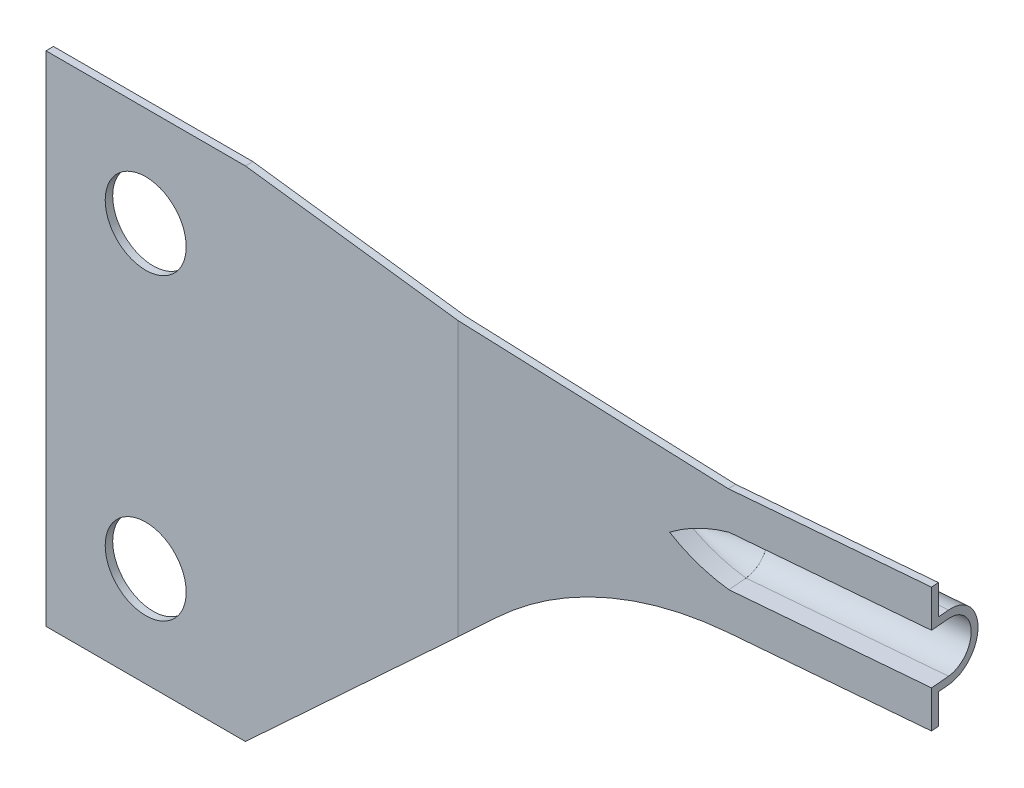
ISO-10303-21;
HEADER;
FILE_DESCRIPTION(('STEP AP214'),'2;1');
FILE_NAME('part.step','',(''),(''),'','','');
FILE_SCHEMA(('AUTOMOTIVE_DESIGN { 1 0 10303 214 1 1 1 1 }'));
ENDSEC;
DATA;
#1=APPLICATION_CONTEXT('core data for automotive mechanical design processes');
#2=APPLICATION_PROTOCOL_DEFINITION('international standard','automotive_design',2000,#1);
#3=PRODUCT_CONTEXT('',#1,'mechanical');
#4=PRODUCT('Part','Part','',(#3));
#5=PRODUCT_RELATED_PRODUCT_CATEGORY('part','',(#4));
#6=PRODUCT_DEFINITION_FORMATION('','',#4);
#7=PRODUCT_DEFINITION_CONTEXT('part definition',#1,'design');
#8=PRODUCT_DEFINITION('design','',#6,#7);
#9=PRODUCT_DEFINITION_SHAPE('','',#8);
#10=(LENGTH_UNIT() NAMED_UNIT(*) SI_UNIT(.MILLI.,.METRE.));
#11=(NAMED_UNIT(*) PLANE_ANGLE_UNIT() SI_UNIT($,.RADIAN.));
#12=(NAMED_UNIT(*) SI_UNIT($,.STERADIAN.) SOLID_ANGLE_UNIT());
#13=UNCERTAINTY_MEASURE_WITH_UNIT(LENGTH_MEASURE(1.E-05),#10,'distance_accuracy_value','');
#14=(GEOMETRIC_REPRESENTATION_CONTEXT(3) GLOBAL_UNCERTAINTY_ASSIGNED_CONTEXT((#13)) GLOBAL_UNIT_ASSIGNED_CONTEXT((#10,
#11,#12)) REPRESENTATION_CONTEXT('',''));
#15=CARTESIAN_POINT('',(0.,0.,0.));
#16=DIRECTION('',(0.,0.,1.));
#17=DIRECTION('',(1.,0.,0.));
#18=AXIS2_PLACEMENT_3D('',#15,#16,#17);
#19=CARTESIAN_POINT('',(33.0763632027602,40.,9.40000000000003));
#20=DIRECTION('',(-0.0871557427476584,0.,-0.996194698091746));
#21=DIRECTION('',(-0.996194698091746,0.,0.0871557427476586));
#22=AXIS2_PLACEMENT_3D('',#19,#20,#21);
#23=PLANE('',#22);
#24=DIRECTION('',(0.,-1.,0.));
#25=VECTOR('',#24,1.);
#26=CARTESIAN_POINT('',(53.004985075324,32.8000000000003,7.65647150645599));
#27=LINE('',#26,#25);
#28=CARTESIAN_POINT('',(53.004985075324,32.8000000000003,7.65647150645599));
#29=VERTEX_POINT('',#28);
#30=CARTESIAN_POINT('',(53.004985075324,32.7982298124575,7.6564715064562));
#31=VERTEX_POINT('',#30);
#32=EDGE_CURVE('E223',#29,#31,#27,.T.);
#33=ORIENTED_EDGE('',*,*,#32,.T.);
#34=CARTESIAN_POINT('',(56.2252552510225,20.467428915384,7.37473437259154));
#35=DIRECTION('',(-0.0871557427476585,0.,-0.996194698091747));
#36=DIRECTION('',(-0.996194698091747,0.,0.0871557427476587));
#37=AXIS2_PLACEMENT_3D('',#34,#35,#36);
#38=CIRCLE('',#37,12.7474768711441);
#39=CARTESIAN_POINT('',(48.0240115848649,30.2000000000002,8.09225022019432));
#40=VERTEX_POINT('',#39);
#41=EDGE_CURVE('E205',#40,#31,#38,.T.);
#42=ORIENTED_EDGE('',*,*,#41,.F.);
#43=CARTESIAN_POINT('',(56.2252552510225,39.932571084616,7.37473437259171));
#44=DIRECTION('',(-0.0871557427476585,0.,-0.996194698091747));
#45=DIRECTION('',(-0.996194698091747,0.,0.0871557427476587));
#46=AXIS2_PLACEMENT_3D('',#43,#44,#45);
#47=CIRCLE('',#46,12.7474768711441);
#48=CARTESIAN_POINT('',(53.004985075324,27.6017701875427,7.65647150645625));
#49=VERTEX_POINT('',#48);
#50=EDGE_CURVE('E214',#49,#40,#47,.T.);
#51=ORIENTED_EDGE('',*,*,#50,.F.);
#52=DIRECTION('',(0.,-1.,0.));
#53=VECTOR('',#52,1.);
#54=CARTESIAN_POINT('',(53.0049850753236,28.1999999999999,7.65647150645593));
#55=LINE('',#54,#53);
#56=CARTESIAN_POINT('',(53.0049850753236,27.6000000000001,7.65647150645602));
#57=VERTEX_POINT('',#56);
#58=EDGE_CURVE('E292',#49,#57,#55,.T.);
#59=ORIENTED_EDGE('',*,*,#58,.T.);
#60=DIRECTION('',(0.996194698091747,0.,-0.0871557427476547));
#61=VECTOR('',#60,1.);
#62=CARTESIAN_POINT('',(53.0049850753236,27.6000000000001,7.65647150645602));
#63=LINE('',#62,#61);
#64=CARTESIAN_POINT('',(67.9479055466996,27.6,6.34913536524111));
#65=VERTEX_POINT('',#64);
#66=EDGE_CURVE('E301',#57,#65,#63,.T.);
#67=ORIENTED_EDGE('',*,*,#66,.T.);
#68=DIRECTION('',(0.,1.,0.));
#69=VECTOR('',#68,1.);
#70=CARTESIAN_POINT('',(67.9479055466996,40.0000000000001,6.34913536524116));
#71=LINE('',#70,#69);
#72=CARTESIAN_POINT('',(67.9479055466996,25.2000000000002,6.34913536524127));
#73=VERTEX_POINT('',#72);
#74=EDGE_CURVE('E11',#73,#65,#71,.T.);
#75=ORIENTED_EDGE('',*,*,#74,.F.);
#76=DIRECTION('',(-0.996194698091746,0.,0.0871557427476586));
#77=VECTOR('',#76,1.);
#78=CARTESIAN_POINT('',(67.6826212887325,25.1999999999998,6.37234473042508));
#79=LINE('',#78,#77);
#80=CARTESIAN_POINT('',(52.9999999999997,25.2000000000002,7.65690764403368));
#81=VERTEX_POINT('',#80);
#82=EDGE_CURVE('E336',#73,#81,#79,.T.);
#83=ORIENTED_EDGE('',*,*,#82,.T.);
#84=CARTESIAN_POINT('',(53.0000000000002,0.199999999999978,7.6569076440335));
#85=DIRECTION('',(-0.0871557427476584,0.,-0.996194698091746));
#86=DIRECTION('',(0.996194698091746,0.,-0.0871557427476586));
#87=AXIS2_PLACEMENT_3D('',#84,#85,#86);
#88=ELLIPSE('',#87,25.0954959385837,25.);
#89=CARTESIAN_POINT('',(36.0089803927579,18.5386273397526,9.14342924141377));
#90=VERTEX_POINT('',#89);
#91=EDGE_CURVE('E338',#81,#90,#88,.F.);
#92=ORIENTED_EDGE('',*,*,#91,.T.);
#93=DIRECTION('',(-0.732039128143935,-0.678245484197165,0.0640451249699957));
#94=VECTOR('',#93,1.);
#95=CARTESIAN_POINT('',(16.041913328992,0.0388333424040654,10.8903212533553));
#96=LINE('',#95,#94);
#97=CARTESIAN_POINT('',(33.07636320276,15.8215125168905,9.40000000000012));
#98=VERTEX_POINT('',#97);
#99=EDGE_CURVE('E340',#90,#98,#96,.T.);
#100=ORIENTED_EDGE('',*,*,#99,.T.);
#101=DIRECTION('',(0.,-1.,0.));
#102=VECTOR('',#101,1.);
#103=CARTESIAN_POINT('',(33.0763632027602,40.,9.40000000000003));
#104=LINE('',#103,#102);
#105=CARTESIAN_POINT('',(33.0763632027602,37.7846880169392,9.40000000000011));
#106=VERTEX_POINT('',#105);
#107=EDGE_CURVE('E315',#106,#98,#104,.T.);
#108=ORIENTED_EDGE('',*,*,#107,.F.);
#109=DIRECTION('',(0.987978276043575,-0.128170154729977,-0.0864368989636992));
#110=VECTOR('',#109,1.);
#111=CARTESIAN_POINT('',(16.0763446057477,39.9900958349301,10.8873089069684));
#112=LINE('',#111,#110);
#113=CARTESIAN_POINT('',(53.0000000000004,35.2,7.65690764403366));
#114=VERTEX_POINT('',#113);
#115=EDGE_CURVE('E398',#106,#114,#112,.T.);
#116=ORIENTED_EDGE('',*,*,#115,.T.);
#117=DIRECTION('',(0.996194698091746,0.,-0.0871557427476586));
#118=VECTOR('',#117,1.);
#119=CARTESIAN_POINT('',(67.682621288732,35.1999999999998,6.37234473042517));
#120=LINE('',#119,#118);
#121=CARTESIAN_POINT('',(67.9479055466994,35.2,6.34913536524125));
#122=VERTEX_POINT('',#121);
#123=EDGE_CURVE('E333',#114,#122,#120,.T.);
#124=ORIENTED_EDGE('',*,*,#123,.T.);
#125=CARTESIAN_POINT('',(67.9479055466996,32.8000000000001,6.34913536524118));
#126=VERTEX_POINT('',#125);
#127=EDGE_CURVE('E42',#126,#122,#71,.T.);
#128=ORIENTED_EDGE('',*,*,#127,.F.);
#129=DIRECTION('',(0.996194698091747,0.,-0.0871557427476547));
#130=VECTOR('',#129,1.);
#131=CARTESIAN_POINT('',(53.004985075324,32.8000000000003,7.65647150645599));
#132=LINE('',#131,#130);
#133=EDGE_CURVE('E308',#29,#126,#132,.T.);
#134=ORIENTED_EDGE('',*,*,#133,.F.);
#135=EDGE_LOOP('',(#33,#42,#51,#59,#67,#75,#83,#92,#100,#108,#116,#124,#128,#134));
#136=FACE_BOUND('',#135,.T.);
#137=ADVANCED_FACE('F34',(#136),#23,.T.);
#138=CARTESIAN_POINT('',(52.926345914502,30.2000000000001,6.75762178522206));
#139=DIRECTION('',(-0.996194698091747,0.,0.0871557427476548));
#140=DIRECTION('',(0.0871557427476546,0.,0.996194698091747));
#141=AXIS2_PLACEMENT_3D('',#138,#139,#140);
#142=PLANE('',#141);
#143=CARTESIAN_POINT('',(52.926345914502,30.2000000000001,6.75762178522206));
#144=DIRECTION('',(0.996194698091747,0.,-0.0871557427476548));
#145=DIRECTION('',(-0.0871557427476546,0.,-0.996194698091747));
#146=AXIS2_PLACEMENT_3D('',#143,#144,#145);
#147=CIRCLE('',#146,2.59822981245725);
#148=CARTESIAN_POINT('',(52.9263459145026,27.601770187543,6.75762178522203));
#149=VERTEX_POINT('',#148);
#150=CARTESIAN_POINT('',(52.9263459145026,32.7982298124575,6.75762178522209));
#151=VERTEX_POINT('',#150);
#152=EDGE_CURVE('E250',#149,#151,#147,.T.);
#153=ORIENTED_EDGE('',*,*,#152,.T.);
#154=DIRECTION('',(0.0871557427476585,0.,0.996194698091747));
#155=VECTOR('',#154,1.);
#156=CARTESIAN_POINT('',(52.2978376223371,32.7982298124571,-0.426260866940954));
#157=LINE('',#156,#155);
#158=EDGE_CURVE('E211',#151,#31,#157,.T.);
#159=ORIENTED_EDGE('',*,*,#158,.T.);
#160=ORIENTED_EDGE('',*,*,#32,.F.);
#161=DIRECTION('',(0.0871557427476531,0.,0.996194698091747));
#162=VECTOR('',#161,1.);
#163=CARTESIAN_POINT('',(52.9263459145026,32.8000000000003,6.7576217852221));
#164=LINE('',#163,#162);
#165=CARTESIAN_POINT('',(52.9263459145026,32.8000000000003,6.7576217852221));
#166=VERTEX_POINT('',#165);
#167=EDGE_CURVE('E281',#166,#29,#164,.T.);
#168=ORIENTED_EDGE('',*,*,#167,.F.);
#169=CARTESIAN_POINT('',(52.926345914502,30.2000000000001,6.75762178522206));
#170=DIRECTION('',(0.996194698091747,0.,-0.0871557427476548));
#171=DIRECTION('',(0.0871557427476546,0.,0.996194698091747));
#172=AXIS2_PLACEMENT_3D('',#169,#170,#171);
#173=CIRCLE('',#172,2.60000000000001);
#174=CARTESIAN_POINT('',(52.9263459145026,27.6000000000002,6.75762178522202));
#175=VERTEX_POINT('',#174);
#176=EDGE_CURVE('E278',#175,#166,#173,.T.);
#177=ORIENTED_EDGE('',*,*,#176,.F.);
#178=DIRECTION('',(-0.0871557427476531,0.,-0.996194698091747));
#179=VECTOR('',#178,1.);
#180=CARTESIAN_POINT('',(52.9263459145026,27.6000000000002,6.75762178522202));
#181=LINE('',#180,#179);
#182=EDGE_CURVE('E294',#57,#175,#181,.T.);
#183=ORIENTED_EDGE('',*,*,#182,.F.);
#184=ORIENTED_EDGE('',*,*,#58,.F.);
#185=DIRECTION('',(0.0871557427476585,0.,0.996194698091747));
#186=VECTOR('',#185,1.);
#187=CARTESIAN_POINT('',(52.2978376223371,27.6017701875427,-0.426260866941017));
#188=LINE('',#187,#186);
#189=EDGE_CURVE('E217',#149,#49,#188,.T.);
#190=ORIENTED_EDGE('',*,*,#189,.F.);
#191=EDGE_LOOP('',(#153,#159,#160,#168,#177,#183,#184,#190));
#192=FACE_BOUND('',#191,.T.);
#193=ADVANCED_FACE('F449',(#192),#142,.T.);
#194=CARTESIAN_POINT('',(16.0000000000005,0.,10.0000000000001));
#195=DIRECTION('',(-0.679640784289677,0.733545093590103,0.));
#196=DIRECTION('',(-0.733545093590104,-0.679640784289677,0.));
#197=AXIS2_PLACEMENT_3D('',#194,#195,#196);
#198=PLANE('',#197);
#199=ORIENTED_EDGE('',*,*,#99,.F.);
#200=DIRECTION('',(0.,0.,-1.));
#201=VECTOR('',#200,1.);
#202=CARTESIAN_POINT('',(36.0089803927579,18.5386273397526,10.0000000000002));
#203=LINE('',#202,#201);
#204=CARTESIAN_POINT('',(36.0089803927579,18.5386273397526,9.7434292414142));
#205=VERTEX_POINT('',#204);
#206=EDGE_CURVE('E387',#205,#90,#203,.T.);
#207=ORIENTED_EDGE('',*,*,#206,.F.);
#208=DIRECTION('',(0.732039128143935,0.678245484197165,-0.0640451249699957));
#209=VECTOR('',#208,1.);
#210=CARTESIAN_POINT('',(16.0700434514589,0.0648963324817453,11.4878601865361));
#211=LINE('',#210,#209);
#212=CARTESIAN_POINT('',(33.0763632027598,15.8215125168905,9.99999999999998));
#213=VERTEX_POINT('',#212);
#214=EDGE_CURVE('E355',#213,#205,#211,.T.);
#215=ORIENTED_EDGE('',*,*,#214,.F.);
#216=DIRECTION('',(0.733545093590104,0.679640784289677,0.));
#217=VECTOR('',#216,1.);
#218=CARTESIAN_POINT('',(16.0000000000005,0.,10.0000000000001));
#219=LINE('',#218,#217);
#220=CARTESIAN_POINT('',(16.0000000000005,0.,10.0000000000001));
#221=VERTEX_POINT('',#220);
#222=EDGE_CURVE('E368',#221,#213,#219,.T.);
#223=ORIENTED_EDGE('',*,*,#222,.F.);
#224=DIRECTION('',(0.,0.,-1.));
#225=VECTOR('',#224,1.);
#226=CARTESIAN_POINT('',(16.0000000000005,0.,10.0000000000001));
#227=LINE('',#226,#225);
#228=CARTESIAN_POINT('',(15.9999999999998,-1.11022302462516E-13,9.40000000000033));
#229=VERTEX_POINT('',#228);
#230=EDGE_CURVE('E390',#221,#229,#227,.T.);
#231=ORIENTED_EDGE('',*,*,#230,.T.);
#232=DIRECTION('',(-0.733545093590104,-0.679640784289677,0.));
#233=VECTOR('',#232,1.);
#234=CARTESIAN_POINT('',(15.9999999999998,-1.11022302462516E-13,9.40000000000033));
#235=LINE('',#234,#233);
#236=EDGE_CURVE('E331',#98,#229,#235,.T.);
#237=ORIENTED_EDGE('',*,*,#236,.F.);
#238=EDGE_LOOP('',(#199,#207,#215,#223,#231,#237));
#239=FACE_BOUND('',#238,.T.);
#240=ADVANCED_FACE('F431',(#239),#198,.F.);
#241=CARTESIAN_POINT('',(53.0000000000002,0.200000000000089,10.0000000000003));
#242=DIRECTION('',(0.,0.,-1.));
#243=DIRECTION('',(-1.,0.,0.));
#244=AXIS2_PLACEMENT_3D('',#241,#242,#243);
#245=CYLINDRICAL_SURFACE('',#244,25.);
#246=ORIENTED_EDGE('',*,*,#91,.F.);
#247=DIRECTION('',(0.,0.,-1.));
#248=VECTOR('',#247,1.);
#249=CARTESIAN_POINT('',(52.9999999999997,25.2000000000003,10.0000000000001));
#250=LINE('',#249,#248);
#251=CARTESIAN_POINT('',(52.9999999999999,25.2000000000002,8.25690764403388));
#252=VERTEX_POINT('',#251);
#253=EDGE_CURVE('E384',#252,#81,#250,.T.);
#254=ORIENTED_EDGE('',*,*,#253,.F.);
#255=CARTESIAN_POINT('',(52.9999999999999,0.199999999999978,8.25690764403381));
#256=DIRECTION('',(0.0871557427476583,0.,0.996194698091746));
#257=DIRECTION('',(0.996194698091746,0.,-0.0871557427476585));
#258=AXIS2_PLACEMENT_3D('',#255,#256,#257);
#259=ELLIPSE('',#258,25.0954959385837,25.);
#260=EDGE_CURVE('E353',#205,#252,#259,.F.);
#261=ORIENTED_EDGE('',*,*,#260,.F.);
#262=ORIENTED_EDGE('',*,*,#206,.T.);
#263=EDGE_LOOP('',(#246,#254,#261,#262));
#264=FACE_BOUND('',#263,.T.);
#265=ADVANCED_FACE('F435',(#264),#245,.F.);
#266=CARTESIAN_POINT('',(67.9999999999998,25.1999999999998,9.99999999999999));
#267=DIRECTION('',(0.,1.,0.));
#268=DIRECTION('',(0.,0.,1.));
#269=AXIS2_PLACEMENT_3D('',#266,#267,#268);
#270=PLANE('',#269);
#271=ORIENTED_EDGE('',*,*,#82,.F.);
#272=DIRECTION('',(-0.0871557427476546,0.,-0.996194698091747));
#273=VECTOR('',#272,1.);
#274=CARTESIAN_POINT('',(68.0000000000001,25.1999999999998,6.94457769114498));
#275=LINE('',#274,#273);
#276=CARTESIAN_POINT('',(68.0000000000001,25.1999999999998,6.94457769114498));
#277=VERTEX_POINT('',#276);
#278=EDGE_CURVE('E300',#277,#73,#275,.T.);
#279=ORIENTED_EDGE('',*,*,#278,.F.);
#280=DIRECTION('',(0.996194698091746,0.,-0.0871557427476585));
#281=VECTOR('',#280,1.);
#282=CARTESIAN_POINT('',(67.7347157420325,25.2,6.9677870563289));
#283=LINE('',#282,#281);
#284=EDGE_CURVE('E350',#252,#277,#283,.T.);
#285=ORIENTED_EDGE('',*,*,#284,.F.);
#286=ORIENTED_EDGE('',*,*,#253,.T.);
#287=EDGE_LOOP('',(#271,#279,#285,#286));
#288=FACE_BOUND('',#287,.T.);
#289=ADVANCED_FACE('F441',(#288),#270,.F.);
#290=CARTESIAN_POINT('',(67.9999999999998,35.1999999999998,10.0000000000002));
#291=DIRECTION('',(0.,-1.,0.));
#292=DIRECTION('',(1.,0.,0.));
#293=AXIS2_PLACEMENT_3D('',#290,#291,#292);
#294=PLANE('',#293);
#295=DIRECTION('',(-0.996194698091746,0.,0.0871557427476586));
#296=VECTOR('',#295,1.);
#297=CARTESIAN_POINT('',(67.7347157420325,35.2,6.967787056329));
#298=LINE('',#297,#296);
#299=CARTESIAN_POINT('',(68.0000000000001,35.2,6.94457769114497));
#300=VERTEX_POINT('',#299);
#301=CARTESIAN_POINT('',(53.0000000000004,35.2000000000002,8.25690764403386));
#302=VERTEX_POINT('',#301);
#303=EDGE_CURVE('E344',#300,#302,#298,.T.);
#304=ORIENTED_EDGE('',*,*,#303,.F.);
#305=DIRECTION('',(-0.0871557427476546,0.,-0.996194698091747));
#306=VECTOR('',#305,1.);
#307=CARTESIAN_POINT('',(68.2652842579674,35.2,9.97679063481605));
#308=LINE('',#307,#306);
#309=EDGE_CURVE('E312',#300,#122,#308,.T.);
#310=ORIENTED_EDGE('',*,*,#309,.T.);
#311=ORIENTED_EDGE('',*,*,#123,.F.);
#312=DIRECTION('',(0.,0.,-1.));
#313=VECTOR('',#312,1.);
#314=CARTESIAN_POINT('',(53.0000000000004,35.2000000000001,10.0000000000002));
#315=LINE('',#314,#313);
#316=EDGE_CURVE('E381',#302,#114,#315,.T.);
#317=ORIENTED_EDGE('',*,*,#316,.F.);
#318=EDGE_LOOP('',(#304,#310,#311,#317));
#319=FACE_BOUND('',#318,.T.);
#320=ADVANCED_FACE('F409',(#319),#294,.F.);
#321=CARTESIAN_POINT('',(16.0000000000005,40.0000000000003,10.));
#322=DIRECTION('',(-0.128651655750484,-0.991689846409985,0.));
#323=DIRECTION('',(0.991689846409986,-0.128651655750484,0.));
#324=AXIS2_PLACEMENT_3D('',#321,#322,#323);
#325=PLANE('',#324);
#326=ORIENTED_EDGE('',*,*,#115,.F.);
#327=DIRECTION('',(0.991689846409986,-0.128651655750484,0.));
#328=VECTOR('',#327,1.);
#329=CARTESIAN_POINT('',(15.9999999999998,40.0000000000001,9.40000000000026));
#330=LINE('',#329,#328);
#331=CARTESIAN_POINT('',(15.9999999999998,40.0000000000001,9.40000000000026));
#332=VERTEX_POINT('',#331);
#333=EDGE_CURVE('E329',#332,#106,#330,.T.);
#334=ORIENTED_EDGE('',*,*,#333,.F.);
#335=DIRECTION('',(0.,0.,-1.));
#336=VECTOR('',#335,1.);
#337=CARTESIAN_POINT('',(16.0000000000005,40.0000000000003,10.));
#338=LINE('',#337,#336);
#339=CARTESIAN_POINT('',(16.0000000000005,40.0000000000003,10.));
#340=VERTEX_POINT('',#339);
#341=EDGE_CURVE('E378',#340,#332,#338,.T.);
#342=ORIENTED_EDGE('',*,*,#341,.F.);
#343=DIRECTION('',(-0.991689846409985,0.128651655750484,0.));
#344=VECTOR('',#343,1.);
#345=CARTESIAN_POINT('',(16.0000000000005,40.0000000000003,10.));
#346=LINE('',#345,#344);
#347=CARTESIAN_POINT('',(33.0763632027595,37.7846880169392,10.0000000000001));
#348=VERTEX_POINT('',#347);
#349=EDGE_CURVE('E371',#348,#340,#346,.T.);
#350=ORIENTED_EDGE('',*,*,#349,.F.);
#351=DIRECTION('',(-0.987978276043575,0.128170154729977,0.0864368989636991));
#352=VECTOR('',#351,1.);
#353=CARTESIAN_POINT('',(16.1275832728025,39.9834486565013,11.482826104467));
#354=LINE('',#353,#352);
#355=EDGE_CURVE('E396',#302,#348,#354,.T.);
#356=ORIENTED_EDGE('',*,*,#355,.F.);
#357=ORIENTED_EDGE('',*,*,#316,.T.);
#358=EDGE_LOOP('',(#326,#334,#342,#350,#356,#357));
#359=FACE_BOUND('',#358,.T.);
#360=ADVANCED_FACE('F418',(#359),#325,.F.);
#361=CARTESIAN_POINT('',(0.,1.11022302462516E-13,9.9999999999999));
#362=DIRECTION('',(1.,0.,0.));
#363=DIRECTION('',(0.,0.,-1.));
#364=AXIS2_PLACEMENT_3D('',#361,#362,#363);
#365=PLANE('',#364);
#366=DIRECTION('',(0.,1.,0.));
#367=VECTOR('',#366,1.);
#368=CARTESIAN_POINT('',(0.,1.11022302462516E-13,9.40000000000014));
#369=LINE('',#368,#367);
#370=CARTESIAN_POINT('',(0.,1.11022302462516E-13,9.40000000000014));
#371=VERTEX_POINT('',#370);
#372=CARTESIAN_POINT('',(0.,39.9999999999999,9.40000000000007));
#373=VERTEX_POINT('',#372);
#374=EDGE_CURVE('E327',#371,#373,#369,.T.);
#375=ORIENTED_EDGE('',*,*,#374,.F.);
#376=DIRECTION('',(0.,0.,-1.));
#377=VECTOR('',#376,1.);
#378=CARTESIAN_POINT('',(0.,1.11022302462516E-13,9.9999999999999));
#379=LINE('',#378,#377);
#380=CARTESIAN_POINT('',(0.,1.11022302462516E-13,9.9999999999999));
#381=VERTEX_POINT('',#380);
#382=EDGE_CURVE('E393',#381,#371,#379,.T.);
#383=ORIENTED_EDGE('',*,*,#382,.F.);
#384=DIRECTION('',(0.,-1.,0.));
#385=VECTOR('',#384,1.);
#386=CARTESIAN_POINT('',(0.,1.11022302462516E-13,9.9999999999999));
#387=LINE('',#386,#385);
#388=CARTESIAN_POINT('',(-2.22044604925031E-13,39.9999999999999,10.0000000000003));
#389=VERTEX_POINT('',#388);
#390=EDGE_CURVE('E363',#389,#381,#387,.T.);
#391=ORIENTED_EDGE('',*,*,#390,.F.);
#392=DIRECTION('',(0.,0.,-1.));
#393=VECTOR('',#392,1.);
#394=CARTESIAN_POINT('',(-2.22044604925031E-13,39.9999999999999,10.0000000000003));
#395=LINE('',#394,#393);
#396=EDGE_CURVE('E375',#389,#373,#395,.T.);
#397=ORIENTED_EDGE('',*,*,#396,.T.);
#398=EDGE_LOOP('',(#375,#383,#391,#397));
#399=FACE_BOUND('',#398,.T.);
#400=ADVANCED_FACE('F36',(#399),#365,.F.);
#401=CARTESIAN_POINT('',(0.,1.11022302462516E-13,9.9999999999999));
#402=DIRECTION('',(0.,1.,0.));
#403=DIRECTION('',(0.,0.,1.));
#404=AXIS2_PLACEMENT_3D('',#401,#402,#403);
#405=PLANE('',#404);
#406=DIRECTION('',(1.,0.,0.));
#407=VECTOR('',#406,1.);
#408=CARTESIAN_POINT('',(-11.0611395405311,3.33066907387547E-13,9.40000000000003));
#409=LINE('',#408,#407);
#410=EDGE_CURVE('E318',#371,#229,#409,.T.);
#411=ORIENTED_EDGE('',*,*,#410,.T.);
#412=ORIENTED_EDGE('',*,*,#230,.F.);
#413=DIRECTION('',(1.,0.,0.));
#414=VECTOR('',#413,1.);
#415=CARTESIAN_POINT('',(0.,1.11022302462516E-13,9.9999999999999));
#416=LINE('',#415,#414);
#417=EDGE_CURVE('E366',#381,#221,#416,.T.);
#418=ORIENTED_EDGE('',*,*,#417,.F.);
#419=ORIENTED_EDGE('',*,*,#382,.T.);
#420=EDGE_LOOP('',(#411,#412,#418,#419));
#421=FACE_BOUND('',#420,.T.);
#422=ADVANCED_FACE('F499',(#421),#405,.F.);
#423=CARTESIAN_POINT('',(-2.22044604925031E-13,39.9999999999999,10.0000000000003));
#424=DIRECTION('',(0.,-1.,0.));
#425=DIRECTION('',(0.,0.,-1.));
#426=AXIS2_PLACEMENT_3D('',#423,#424,#425);
#427=PLANE('',#426);
#428=DIRECTION('',(1.,0.,0.));
#429=VECTOR('',#428,1.);
#430=CARTESIAN_POINT('',(-11.0611395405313,40.,9.40000000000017));
#431=LINE('',#430,#429);
#432=EDGE_CURVE('E319',#373,#332,#431,.T.);
#433=ORIENTED_EDGE('',*,*,#432,.F.);
#434=ORIENTED_EDGE('',*,*,#396,.F.);
#435=DIRECTION('',(-1.,0.,0.));
#436=VECTOR('',#435,1.);
#437=CARTESIAN_POINT('',(-2.22044604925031E-13,39.9999999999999,10.0000000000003));
#438=LINE('',#437,#436);
#439=EDGE_CURVE('E373',#340,#389,#438,.T.);
#440=ORIENTED_EDGE('',*,*,#439,.F.);
#441=ORIENTED_EDGE('',*,*,#341,.T.);
#442=EDGE_LOOP('',(#433,#434,#440,#441));
#443=FACE_BOUND('',#442,.T.);
#444=ADVANCED_FACE('F492',(#443),#427,.F.);
#445=CARTESIAN_POINT('',(8.00000000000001,31.9999999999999,9.99999999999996));
#446=DIRECTION('',(0.,0.,-1.));
#447=DIRECTION('',(-1.,0.,0.));
#448=AXIS2_PLACEMENT_3D('',#445,#446,#447);
#449=CYLINDRICAL_SURFACE('',#448,3.25);
#450=CARTESIAN_POINT('',(8.00000000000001,31.9999999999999,9.99999999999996));
#451=DIRECTION('',(0.,0.,1.));
#452=DIRECTION('',(1.,0.,0.));
#453=AXIS2_PLACEMENT_3D('',#450,#451,#452);
#454=CIRCLE('',#453,3.25);
#455=CARTESIAN_POINT('',(11.25,31.9999999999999,9.99999999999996));
#456=VERTEX_POINT('',#455);
#457=EDGE_CURVE('E360',#456,#456,#454,.T.);
#458=ORIENTED_EDGE('',*,*,#457,.T.);
#459=EDGE_LOOP('',(#458));
#460=FACE_BOUND('',#459,.T.);
#461=CARTESIAN_POINT('',(7.99999999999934,31.9999999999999,9.40000000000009));
#462=DIRECTION('',(0.,0.,-1.));
#463=DIRECTION('',(-1.,0.,0.));
#464=AXIS2_PLACEMENT_3D('',#461,#462,#463);
#465=CIRCLE('',#464,3.25);
#466=CARTESIAN_POINT('',(4.74999999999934,31.9999999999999,9.40000000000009));
#467=VERTEX_POINT('',#466);
#468=EDGE_CURVE('E324',#467,#467,#465,.T.);
#469=ORIENTED_EDGE('',*,*,#468,.T.);
#470=EDGE_LOOP('',(#469));
#471=FACE_BOUND('',#470,.T.);
#472=ADVANCED_FACE('F488',(#460,#471),#449,.F.);
#473=CARTESIAN_POINT('',(8.00000000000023,7.9999999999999,10.0000000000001));
#474=DIRECTION('',(0.,0.,-1.));
#475=DIRECTION('',(-1.,0.,0.));
#476=AXIS2_PLACEMENT_3D('',#473,#474,#475);
#477=CYLINDRICAL_SURFACE('',#476,3.25);
#478=CARTESIAN_POINT('',(8.00000000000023,7.9999999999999,10.0000000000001));
#479=DIRECTION('',(0.,0.,1.));
#480=DIRECTION('',(1.,0.,0.));
#481=AXIS2_PLACEMENT_3D('',#478,#479,#480);
#482=CIRCLE('',#481,3.25);
#483=CARTESIAN_POINT('',(11.2500000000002,7.9999999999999,10.0000000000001));
#484=VERTEX_POINT('',#483);
#485=EDGE_CURVE('E357',#484,#484,#482,.T.);
#486=ORIENTED_EDGE('',*,*,#485,.T.);
#487=EDGE_LOOP('',(#486));
#488=FACE_BOUND('',#487,.T.);
#489=CARTESIAN_POINT('',(8.00000000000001,7.99999999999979,9.40000000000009));
#490=DIRECTION('',(0.,0.,-1.));
#491=DIRECTION('',(-1.,0.,0.));
#492=AXIS2_PLACEMENT_3D('',#489,#490,#491);
#493=CIRCLE('',#492,3.25);
#494=CARTESIAN_POINT('',(4.75,7.99999999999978,9.40000000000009));
#495=VERTEX_POINT('',#494);
#496=EDGE_CURVE('E321',#495,#495,#493,.T.);
#497=ORIENTED_EDGE('',*,*,#496,.T.);
#498=EDGE_LOOP('',(#497));
#499=FACE_BOUND('',#498,.T.);
#500=ADVANCED_FACE('F485',(#488,#499),#477,.F.);
#501=CARTESIAN_POINT('',(53.0000000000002,0.200000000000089,10.0000000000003));
#502=DIRECTION('',(0.,0.,1.));
#503=DIRECTION('',(1.,0.,0.));
#504=AXIS2_PLACEMENT_3D('',#501,#502,#503);
#505=PLANE('',#504);
#506=ORIENTED_EDGE('',*,*,#485,.F.);
#507=EDGE_LOOP('',(#506));
#508=FACE_BOUND('',#507,.T.);
#509=ORIENTED_EDGE('',*,*,#457,.F.);
#510=EDGE_LOOP('',(#509));
#511=FACE_BOUND('',#510,.T.);
#512=ORIENTED_EDGE('',*,*,#222,.T.);
#513=DIRECTION('',(0.,-1.,0.));
#514=VECTOR('',#513,1.);
#515=CARTESIAN_POINT('',(33.0763632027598,40.,10.));
#516=LINE('',#515,#514);
#517=EDGE_CURVE('E342',#348,#213,#516,.T.);
#518=ORIENTED_EDGE('',*,*,#517,.F.);
#519=ORIENTED_EDGE('',*,*,#349,.T.);
#520=ORIENTED_EDGE('',*,*,#439,.T.);
#521=ORIENTED_EDGE('',*,*,#390,.T.);
#522=ORIENTED_EDGE('',*,*,#417,.T.);
#523=EDGE_LOOP('',(#512,#518,#519,#520,#521,#522));
#524=FACE_BOUND('',#523,.T.);
#525=ADVANCED_FACE('F423',(#508,#511,#524),#505,.T.);
#526=CARTESIAN_POINT('',(33.0763632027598,40.,10.));
#527=DIRECTION('',(0.0871557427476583,0.,0.996194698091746));
#528=DIRECTION('',(0.996194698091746,0.,-0.0871557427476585));
#529=AXIS2_PLACEMENT_3D('',#526,#527,#528);
#530=PLANE('',#529);
#531=CARTESIAN_POINT('',(55.4678860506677,21.0260769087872,8.0409955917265));
#532=DIRECTION('',(0.0871557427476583,0.,0.996194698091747));
#533=DIRECTION('',(0.996194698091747,0.,-0.0871557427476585));
#534=AXIS2_PLACEMENT_3D('',#531,#532,#533);
#535=CIRCLE('',#534,11.4312499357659);
#536=CARTESIAN_POINT('',(53.057079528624,32.1982298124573,8.25191383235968));
#537=VERTEX_POINT('',#536);
#538=CARTESIAN_POINT('',(48.6738228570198,30.2000000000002,8.63539910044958));
#539=VERTEX_POINT('',#538);
#540=EDGE_CURVE('E228',#537,#539,#535,.T.);
#541=ORIENTED_EDGE('',*,*,#540,.F.);
#542=DIRECTION('',(0.,-1.,0.));
#543=VECTOR('',#542,1.);
#544=CARTESIAN_POINT('',(53.057079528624,32.1999999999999,8.25191383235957));
#545=LINE('',#544,#543);
#546=CARTESIAN_POINT('',(53.057079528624,32.1999999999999,8.25191383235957));
#547=VERTEX_POINT('',#546);
#548=EDGE_CURVE('E254',#547,#537,#545,.T.);
#549=ORIENTED_EDGE('',*,*,#548,.F.);
#550=DIRECTION('',(0.996194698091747,0.,-0.0871557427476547));
#551=VECTOR('',#550,1.);
#552=CARTESIAN_POINT('',(53.057079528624,32.1999999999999,8.25191383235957));
#553=LINE('',#552,#551);
#554=CARTESIAN_POINT('',(68.0000000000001,32.1999999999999,6.94457769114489));
#555=VERTEX_POINT('',#554);
#556=EDGE_CURVE('E257',#547,#555,#553,.T.);
#557=ORIENTED_EDGE('',*,*,#556,.T.);
#558=DIRECTION('',(0.,1.,0.));
#559=VECTOR('',#558,1.);
#560=CARTESIAN_POINT('',(68.0000000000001,35.2,6.94457769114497));
#561=LINE('',#560,#559);
#562=EDGE_CURVE('E346',#555,#300,#561,.T.);
#563=ORIENTED_EDGE('',*,*,#562,.T.);
#564=ORIENTED_EDGE('',*,*,#303,.T.);
#565=ORIENTED_EDGE('',*,*,#355,.T.);
#566=ORIENTED_EDGE('',*,*,#517,.T.);
#567=ORIENTED_EDGE('',*,*,#214,.T.);
#568=ORIENTED_EDGE('',*,*,#260,.T.);
#569=ORIENTED_EDGE('',*,*,#284,.T.);
#570=CARTESIAN_POINT('',(68.0000000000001,28.1999999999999,6.94457769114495));
#571=VERTEX_POINT('',#570);
#572=EDGE_CURVE('E347',#277,#571,#561,.T.);
#573=ORIENTED_EDGE('',*,*,#572,.T.);
#574=DIRECTION('',(0.996194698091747,0.,-0.0871557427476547));
#575=VECTOR('',#574,1.);
#576=CARTESIAN_POINT('',(53.0570795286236,28.1999999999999,8.25191383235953));
#577=LINE('',#576,#575);
#578=CARTESIAN_POINT('',(53.0570795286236,28.1999999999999,8.25191383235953));
#579=VERTEX_POINT('',#578);
#580=EDGE_CURVE('E258',#579,#571,#577,.T.);
#581=ORIENTED_EDGE('',*,*,#580,.F.);
#582=CARTESIAN_POINT('',(53.0570795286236,28.2017701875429,8.25191383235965));
#583=VERTEX_POINT('',#582);
#584=EDGE_CURVE('E253',#583,#579,#545,.T.);
#585=ORIENTED_EDGE('',*,*,#584,.F.);
#586=CARTESIAN_POINT('',(55.4678860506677,39.3739230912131,8.04099559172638));
#587=DIRECTION('',(0.0871557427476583,0.,0.996194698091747));
#588=DIRECTION('',(0.996194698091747,0.,-0.0871557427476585));
#589=AXIS2_PLACEMENT_3D('',#586,#587,#588);
#590=CIRCLE('',#589,11.4312499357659);
#591=EDGE_CURVE('E49',#539,#583,#590,.T.);
#592=ORIENTED_EDGE('',*,*,#591,.F.);
#593=EDGE_LOOP('',(#541,#549,#557,#563,#564,#565,#566,#567,#568,#569,#573,#581,#585,#592));
#594=FACE_BOUND('',#593,.T.);
#595=ADVANCED_FACE('F414',(#594),#530,.T.);
#596=CARTESIAN_POINT('',(-11.0611395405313,40.,9.40000000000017));
#597=DIRECTION('',(0.,0.,-1.));
#598=DIRECTION('',(-1.,0.,0.));
#599=AXIS2_PLACEMENT_3D('',#596,#597,#598);
#600=PLANE('',#599);
#601=ORIENTED_EDGE('',*,*,#496,.F.);
#602=EDGE_LOOP('',(#601));
#603=FACE_BOUND('',#602,.T.);
#604=ORIENTED_EDGE('',*,*,#468,.F.);
#605=EDGE_LOOP('',(#604));
#606=FACE_BOUND('',#605,.T.);
#607=ORIENTED_EDGE('',*,*,#236,.T.);
#608=ORIENTED_EDGE('',*,*,#410,.F.);
#609=ORIENTED_EDGE('',*,*,#374,.T.);
#610=ORIENTED_EDGE('',*,*,#432,.T.);
#611=ORIENTED_EDGE('',*,*,#333,.T.);
#612=ORIENTED_EDGE('',*,*,#107,.T.);
#613=EDGE_LOOP('',(#607,#608,#609,#610,#611,#612));
#614=FACE_BOUND('',#613,.T.);
#615=ADVANCED_FACE('F479',(#603,#606,#614),#600,.T.);
#616=CARTESIAN_POINT('',(68.0000000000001,40.,6.94457769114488));
#617=DIRECTION('',(-0.996194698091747,0.,0.0871557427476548));
#618=DIRECTION('',(0.0871557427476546,0.,0.996194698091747));
#619=AXIS2_PLACEMENT_3D('',#616,#617,#618);
#620=PLANE('',#619);
#621=DIRECTION('',(0.0871557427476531,0.,0.996194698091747));
#622=VECTOR('',#621,1.);
#623=CARTESIAN_POINT('',(67.9479055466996,28.2,6.34913536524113));
#624=LINE('',#623,#622);
#625=CARTESIAN_POINT('',(67.8692663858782,28.2,5.45028564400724));
#626=VERTEX_POINT('',#625);
#627=EDGE_CURVE('E273',#626,#571,#624,.T.);
#628=ORIENTED_EDGE('',*,*,#627,.T.);
#629=ORIENTED_EDGE('',*,*,#572,.F.);
#630=ORIENTED_EDGE('',*,*,#278,.T.);
#631=ORIENTED_EDGE('',*,*,#74,.T.);
#632=DIRECTION('',(-0.0871557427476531,0.,-0.996194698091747));
#633=VECTOR('',#632,1.);
#634=CARTESIAN_POINT('',(67.8692663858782,27.6,5.45028564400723));
#635=LINE('',#634,#633);
#636=CARTESIAN_POINT('',(67.8692663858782,27.6,5.45028564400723));
#637=VERTEX_POINT('',#636);
#638=EDGE_CURVE('E275',#65,#637,#635,.T.);
#639=ORIENTED_EDGE('',*,*,#638,.T.);
#640=CARTESIAN_POINT('',(67.8692663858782,30.2000000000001,5.45028564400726));
#641=DIRECTION('',(0.996194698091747,0.,-0.0871557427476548));
#642=DIRECTION('',(0.0871557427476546,0.,0.996194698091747));
#643=AXIS2_PLACEMENT_3D('',#640,#641,#642);
#644=CIRCLE('',#643,2.60000000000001);
#645=CARTESIAN_POINT('',(67.8692663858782,32.7999999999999,5.45028564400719));
#646=VERTEX_POINT('',#645);
#647=EDGE_CURVE('E261',#637,#646,#644,.T.);
#648=ORIENTED_EDGE('',*,*,#647,.T.);
#649=DIRECTION('',(0.0871557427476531,0.,0.996194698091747));
#650=VECTOR('',#649,1.);
#651=CARTESIAN_POINT('',(67.8692663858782,32.7999999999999,5.45028564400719));
#652=LINE('',#651,#650);
#653=EDGE_CURVE('E57',#646,#126,#652,.T.);
#654=ORIENTED_EDGE('',*,*,#653,.T.);
#655=ORIENTED_EDGE('',*,*,#127,.T.);
#656=ORIENTED_EDGE('',*,*,#309,.F.);
#657=ORIENTED_EDGE('',*,*,#562,.F.);
#658=DIRECTION('',(-0.0871557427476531,0.,-0.996194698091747));
#659=VECTOR('',#658,1.);
#660=CARTESIAN_POINT('',(67.9479055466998,32.1999999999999,6.34913536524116));
#661=LINE('',#660,#659);
#662=CARTESIAN_POINT('',(67.8692663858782,32.2,5.45028564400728));
#663=VERTEX_POINT('',#662);
#664=EDGE_CURVE('E267',#555,#663,#661,.T.);
#665=ORIENTED_EDGE('',*,*,#664,.T.);
#666=CARTESIAN_POINT('',(67.8692663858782,30.2000000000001,5.45028564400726));
#667=DIRECTION('',(-0.996194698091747,0.,0.0871557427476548));
#668=DIRECTION('',(0.0871557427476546,0.,0.996194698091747));
#669=AXIS2_PLACEMENT_3D('',#666,#667,#668);
#670=CIRCLE('',#669,2.);
#671=EDGE_CURVE('E270',#663,#626,#670,.T.);
#672=ORIENTED_EDGE('',*,*,#671,.T.);
#673=EDGE_LOOP('',(#628,#629,#630,#631,#639,#648,#654,#655,#656,#657,#665,#672));
#674=FACE_BOUND('',#673,.T.);
#675=ADVANCED_FACE('F405',(#674),#620,.F.);
#676=CARTESIAN_POINT('',(52.926345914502,30.2000000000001,6.75762178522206));
#677=DIRECTION('',(0.996194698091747,0.,-0.0871557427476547));
#678=DIRECTION('',(-0.0871557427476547,0.,-0.996194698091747));
#679=AXIS2_PLACEMENT_3D('',#676,#677,#678);
#680=CYLINDRICAL_SURFACE('',#679,2.60000000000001);
#681=ORIENTED_EDGE('',*,*,#647,.F.);
#682=DIRECTION('',(0.996194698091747,0.,-0.0871557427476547));
#683=VECTOR('',#682,1.);
#684=CARTESIAN_POINT('',(52.9263459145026,27.6000000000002,6.75762178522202));
#685=LINE('',#684,#683);
#686=EDGE_CURVE('E298',#175,#637,#685,.T.);
#687=ORIENTED_EDGE('',*,*,#686,.F.);
#688=ORIENTED_EDGE('',*,*,#176,.T.);
#689=DIRECTION('',(0.996194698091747,0.,-0.0871557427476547));
#690=VECTOR('',#689,1.);
#691=CARTESIAN_POINT('',(52.9263459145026,32.8000000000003,6.7576217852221));
#692=LINE('',#691,#690);
#693=EDGE_CURVE('E297',#166,#646,#692,.T.);
#694=ORIENTED_EDGE('',*,*,#693,.T.);
#695=EDGE_LOOP('',(#681,#687,#688,#694));
#696=FACE_BOUND('',#695,.T.);
#697=ADVANCED_FACE('F453',(#696),#680,.T.);
#698=CARTESIAN_POINT('',(52.9263459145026,27.6000000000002,6.75762178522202));
#699=DIRECTION('',(0.,-1.,0.));
#700=DIRECTION('',(0.,0.,-1.));
#701=AXIS2_PLACEMENT_3D('',#698,#699,#700);
#702=PLANE('',#701);
#703=ORIENTED_EDGE('',*,*,#638,.F.);
#704=ORIENTED_EDGE('',*,*,#66,.F.);
#705=ORIENTED_EDGE('',*,*,#182,.T.);
#706=ORIENTED_EDGE('',*,*,#686,.T.);
#707=EDGE_LOOP('',(#703,#704,#705,#706));
#708=FACE_BOUND('',#707,.T.);
#709=ADVANCED_FACE('F446',(#708),#702,.T.);
#710=CARTESIAN_POINT('',(53.0049850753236,28.1999999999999,7.65647150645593));
#711=DIRECTION('',(0.,1.,0.));
#712=DIRECTION('',(0.,0.,1.));
#713=AXIS2_PLACEMENT_3D('',#710,#711,#712);
#714=PLANE('',#713);
#715=ORIENTED_EDGE('',*,*,#627,.F.);
#716=DIRECTION('',(0.996194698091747,0.,-0.0871557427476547));
#717=VECTOR('',#716,1.);
#718=CARTESIAN_POINT('',(52.926345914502,28.2000000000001,6.75762178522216));
#719=LINE('',#718,#717);
#720=CARTESIAN_POINT('',(52.926345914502,28.2000000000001,6.75762178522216));
#721=VERTEX_POINT('',#720);
#722=EDGE_CURVE('E304',#721,#626,#719,.T.);
#723=ORIENTED_EDGE('',*,*,#722,.F.);
#724=DIRECTION('',(0.0871557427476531,0.,0.996194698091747));
#725=VECTOR('',#724,1.);
#726=CARTESIAN_POINT('',(53.0049850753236,28.1999999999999,7.65647150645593));
#727=LINE('',#726,#725);
#728=EDGE_CURVE('E290',#721,#579,#727,.T.);
#729=ORIENTED_EDGE('',*,*,#728,.T.);
#730=ORIENTED_EDGE('',*,*,#580,.T.);
#731=EDGE_LOOP('',(#715,#723,#729,#730));
#732=FACE_BOUND('',#731,.T.);
#733=ADVANCED_FACE('F615',(#732),#714,.T.);
#734=CARTESIAN_POINT('',(52.926345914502,30.2000000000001,6.75762178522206));
#735=DIRECTION('',(0.996194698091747,0.,-0.0871557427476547));
#736=DIRECTION('',(-0.0871557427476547,0.,-0.996194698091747));
#737=AXIS2_PLACEMENT_3D('',#734,#735,#736);
#738=CYLINDRICAL_SURFACE('',#737,2.);
#739=ORIENTED_EDGE('',*,*,#671,.F.);
#740=DIRECTION('',(0.996194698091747,0.,-0.0871557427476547));
#741=VECTOR('',#740,1.);
#742=CARTESIAN_POINT('',(52.9263459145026,32.2000000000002,6.75762178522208));
#743=LINE('',#742,#741);
#744=CARTESIAN_POINT('',(52.9263459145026,32.2000000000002,6.75762178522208));
#745=VERTEX_POINT('',#744);
#746=EDGE_CURVE('E306',#745,#663,#743,.T.);
#747=ORIENTED_EDGE('',*,*,#746,.F.);
#748=CARTESIAN_POINT('',(52.926345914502,30.2000000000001,6.75762178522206));
#749=DIRECTION('',(-0.996194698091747,0.,0.0871557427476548));
#750=DIRECTION('',(0.0871557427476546,0.,0.996194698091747));
#751=AXIS2_PLACEMENT_3D('',#748,#749,#750);
#752=CIRCLE('',#751,2.);
#753=EDGE_CURVE('E288',#745,#721,#752,.T.);
#754=ORIENTED_EDGE('',*,*,#753,.T.);
#755=ORIENTED_EDGE('',*,*,#722,.T.);
#756=EDGE_LOOP('',(#739,#747,#754,#755));
#757=FACE_BOUND('',#756,.T.);
#758=ADVANCED_FACE('F467',(#757),#738,.F.);
#759=CARTESIAN_POINT('',(53.004985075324,32.2000000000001,7.65647150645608));
#760=DIRECTION('',(0.,-1.,0.));
#761=DIRECTION('',(0.,0.,-1.));
#762=AXIS2_PLACEMENT_3D('',#759,#760,#761);
#763=PLANE('',#762);
#764=ORIENTED_EDGE('',*,*,#664,.F.);
#765=ORIENTED_EDGE('',*,*,#556,.F.);
#766=DIRECTION('',(-0.0871557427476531,0.,-0.996194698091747));
#767=VECTOR('',#766,1.);
#768=CARTESIAN_POINT('',(53.004985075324,32.2000000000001,7.65647150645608));
#769=LINE('',#768,#767);
#770=EDGE_CURVE('E285',#547,#745,#769,.T.);
#771=ORIENTED_EDGE('',*,*,#770,.T.);
#772=ORIENTED_EDGE('',*,*,#746,.T.);
#773=EDGE_LOOP('',(#764,#765,#771,#772));
#774=FACE_BOUND('',#773,.T.);
#775=ADVANCED_FACE('F458',(#774),#763,.T.);
#776=CARTESIAN_POINT('',(52.9263459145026,32.8000000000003,6.7576217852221));
#777=DIRECTION('',(0.,1.,0.));
#778=DIRECTION('',(0.,0.,1.));
#779=AXIS2_PLACEMENT_3D('',#776,#777,#778);
#780=PLANE('',#779);
#781=ORIENTED_EDGE('',*,*,#653,.F.);
#782=ORIENTED_EDGE('',*,*,#693,.F.);
#783=ORIENTED_EDGE('',*,*,#167,.T.);
#784=ORIENTED_EDGE('',*,*,#133,.T.);
#785=EDGE_LOOP('',(#781,#782,#783,#784));
#786=FACE_BOUND('',#785,.T.);
#787=ADVANCED_FACE('F455',(#786),#780,.T.);
#788=CARTESIAN_POINT('',(53.0049850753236,28.1999999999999,7.65647150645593));
#789=DIRECTION('',(-0.996194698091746,0.,0.0871557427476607));
#790=DIRECTION('',(0.0871557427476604,0.,0.996194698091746));
#791=AXIS2_PLACEMENT_3D('',#788,#789,#790);
#792=PLANE('',#791);
#793=ORIENTED_EDGE('',*,*,#584,.T.);
#794=ORIENTED_EDGE('',*,*,#728,.F.);
#795=ORIENTED_EDGE('',*,*,#753,.F.);
#796=ORIENTED_EDGE('',*,*,#770,.F.);
#797=ORIENTED_EDGE('',*,*,#548,.T.);
#798=DIRECTION('',(0.0871557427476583,0.,0.996194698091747));
#799=VECTOR('',#798,1.);
#800=CARTESIAN_POINT('',(52.4869272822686,32.1982298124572,1.73504383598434));
#801=LINE('',#800,#799);
#802=CARTESIAN_POINT('',(52.9263459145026,32.1982298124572,6.75762178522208));
#803=VERTEX_POINT('',#802);
#804=EDGE_CURVE('E231',#803,#537,#801,.T.);
#805=ORIENTED_EDGE('',*,*,#804,.F.);
#806=CARTESIAN_POINT('',(52.926345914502,30.2000000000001,6.75762178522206));
#807=DIRECTION('',(0.996194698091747,0.,-0.0871557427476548));
#808=DIRECTION('',(-0.0871557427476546,0.,-0.996194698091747));
#809=AXIS2_PLACEMENT_3D('',#806,#807,#808);
#810=CIRCLE('',#809,1.99822981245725);
#811=CARTESIAN_POINT('',(52.926345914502,28.2017701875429,6.75762178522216));
#812=VERTEX_POINT('',#811);
#813=EDGE_CURVE('E247',#812,#803,#810,.T.);
#814=ORIENTED_EDGE('',*,*,#813,.F.);
#815=DIRECTION('',(0.0871557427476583,0.,0.996194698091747));
#816=VECTOR('',#815,1.);
#817=CARTESIAN_POINT('',(52.4869272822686,28.2017701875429,1.73504383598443));
#818=LINE('',#817,#816);
#819=EDGE_CURVE('E235',#812,#583,#818,.T.);
#820=ORIENTED_EDGE('',*,*,#819,.T.);
#821=EDGE_LOOP('',(#793,#794,#795,#796,#797,#805,#814,#820));
#822=FACE_BOUND('',#821,.T.);
#823=ADVANCED_FACE('F457',(#822),#792,.F.);
#824=CARTESIAN_POINT('',(56.9948655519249,30.2,16.1714203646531));
#825=DIRECTION('',(0.,-1.,0.));
#826=DIRECTION('',(-0.0871557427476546,0.,-0.996194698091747));
#827=AXIS2_PLACEMENT_3D('',#824,#825,#826);
#828=CIRCLE('',#827,12.747476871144);
#829=TRIMMED_CURVE('',#828,(PARAMETER_VALUE(-0.702096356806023)),
(PARAMETER_VALUE(0.702096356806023)),.T.,.PARAMETER.);
#830=CARTESIAN_POINT('',(56.1466160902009,30.2,6.47588465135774));
#831=DIRECTION('',(0.996194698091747,0.,-0.0871557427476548));
#832=AXIS1_PLACEMENT('',#830,#831);
#833=SURFACE_OF_REVOLUTION('',#829,#832);
#834=ORIENTED_EDGE('',*,*,#152,.F.);
#835=CARTESIAN_POINT('',(56.1466160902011,39.9325710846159,6.47588465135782));
#836=DIRECTION('',(-0.0871557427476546,0.,-0.996194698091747));
#837=DIRECTION('',(0.0868240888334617,-0.996194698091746,-0.00759612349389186));
#838=AXIS2_PLACEMENT_3D('',#835,#836,#837);
#839=CIRCLE('',#838,12.747476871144);
#840=CARTESIAN_POINT('',(47.9453724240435,30.2000000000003,7.19340049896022));
#841=VERTEX_POINT('',#840);
#842=EDGE_CURVE('E242',#149,#841,#839,.T.);
#843=ORIENTED_EDGE('',*,*,#842,.T.);
#844=CARTESIAN_POINT('',(56.1466160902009,20.4674289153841,6.47588465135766));
#845=DIRECTION('',(0.0871557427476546,0.,0.996194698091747));
#846=DIRECTION('',(0.0868240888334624,0.996194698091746,-0.00759612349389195));
#847=AXIS2_PLACEMENT_3D('',#844,#845,#846);
#848=CIRCLE('',#847,12.747476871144);
#849=EDGE_CURVE('E208',#151,#841,#848,.T.);
#850=ORIENTED_EDGE('',*,*,#849,.F.);
#851=EDGE_LOOP('',(#834,#843,#850));
#852=FACE_BOUND('',#851,.T.);
#853=ADVANCED_FACE('F464',(#852),#833,.T.);
#854=CARTESIAN_POINT('',(56.1367125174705,30.1999999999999,15.6857170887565));
#855=DIRECTION('',(0.,-1.,0.));
#856=DIRECTION('',(-0.0871557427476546,0.,-0.996194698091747));
#857=AXIS2_PLACEMENT_3D('',#854,#855,#856);
#858=CIRCLE('',#857,11.4312499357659);
#859=TRIMMED_CURVE('',#858,(PARAMETER_VALUE(-0.639272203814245)),
(PARAMETER_VALUE(0.639272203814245)),.T.,.PARAMETER.);
#860=CARTESIAN_POINT('',(55.337152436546,30.1999999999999,6.54670354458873));
#861=DIRECTION('',(0.996194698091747,0.,-0.0871557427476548));
#862=AXIS1_PLACEMENT('',#860,#861);
#863=SURFACE_OF_REVOLUTION('',#859,#862);
#864=ORIENTED_EDGE('',*,*,#813,.T.);
#865=CARTESIAN_POINT('',(55.3371524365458,21.0260769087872,6.54670354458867));
#866=DIRECTION('',(-0.0871557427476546,0.,-0.996194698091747));
#867=DIRECTION('',(0.0868240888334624,0.996194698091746,-0.00759612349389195));
#868=AXIS2_PLACEMENT_3D('',#865,#866,#867);
#869=CIRCLE('',#868,11.4312499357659);
#870=CARTESIAN_POINT('',(48.5430892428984,30.2000000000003,7.14110705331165));
#871=VERTEX_POINT('',#870);
#872=EDGE_CURVE('E239',#871,#803,#869,.T.);
#873=ORIENTED_EDGE('',*,*,#872,.F.);
#874=CARTESIAN_POINT('',(55.3371524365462,39.373923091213,6.54670354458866));
#875=DIRECTION('',(0.0871557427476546,0.,0.996194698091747));
#876=DIRECTION('',(0.0868240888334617,-0.996194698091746,-0.00759612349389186));
#877=AXIS2_PLACEMENT_3D('',#874,#875,#876);
#878=CIRCLE('',#877,11.4312499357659);
#879=EDGE_CURVE('E244',#871,#812,#878,.T.);
#880=ORIENTED_EDGE('',*,*,#879,.T.);
#881=EDGE_LOOP('',(#864,#873,#880));
#882=FACE_BOUND('',#881,.T.);
#883=ADVANCED_FACE('F583',(#882),#863,.F.);
#884=CARTESIAN_POINT('',(54.8977338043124,21.0260769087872,1.52412559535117));
#885=DIRECTION('',(0.0871557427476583,0.,0.996194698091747));
#886=DIRECTION('',(0.996194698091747,0.,-0.0871557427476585));
#887=AXIS2_PLACEMENT_3D('',#884,#885,#886);
#888=CYLINDRICAL_SURFACE('',#887,11.4312499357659);
#889=ORIENTED_EDGE('',*,*,#804,.T.);
#890=ORIENTED_EDGE('',*,*,#540,.T.);
#891=DIRECTION('',(0.0871557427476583,0.,0.996194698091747));
#892=VECTOR('',#891,1.);
#893=CARTESIAN_POINT('',(48.1036706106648,30.2000000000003,2.11852910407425));
#894=LINE('',#893,#892);
#895=EDGE_CURVE('E233',#871,#539,#894,.T.);
#896=ORIENTED_EDGE('',*,*,#895,.F.);
#897=ORIENTED_EDGE('',*,*,#872,.T.);
#898=EDGE_LOOP('',(#889,#890,#896,#897));
#899=FACE_BOUND('',#898,.T.);
#900=ADVANCED_FACE('F579',(#899),#888,.F.);
#901=CARTESIAN_POINT('',(54.8977338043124,39.3739230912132,1.52412559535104));
#902=DIRECTION('',(0.0871557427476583,0.,0.996194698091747));
#903=DIRECTION('',(0.996194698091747,0.,-0.0871557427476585));
#904=AXIS2_PLACEMENT_3D('',#901,#902,#903);
#905=CYLINDRICAL_SURFACE('',#904,11.4312499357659);
#906=ORIENTED_EDGE('',*,*,#895,.T.);
#907=ORIENTED_EDGE('',*,*,#591,.T.);
#908=ORIENTED_EDGE('',*,*,#819,.F.);
#909=ORIENTED_EDGE('',*,*,#879,.F.);
#910=EDGE_LOOP('',(#906,#907,#908,#909));
#911=FACE_BOUND('',#910,.T.);
#912=ADVANCED_FACE('F552',(#911),#905,.F.);
#913=CARTESIAN_POINT('',(55.5181077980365,20.4674289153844,-0.707998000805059));
#914=DIRECTION('',(0.0871557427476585,0.,0.996194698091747));
#915=DIRECTION('',(0.996194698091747,0.,-0.0871557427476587));
#916=AXIS2_PLACEMENT_3D('',#913,#914,#915);
#917=CYLINDRICAL_SURFACE('',#916,12.7474768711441);
#918=ORIENTED_EDGE('',*,*,#158,.F.);
#919=ORIENTED_EDGE('',*,*,#849,.T.);
#920=DIRECTION('',(0.0871557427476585,0.,0.996194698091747));
#921=VECTOR('',#920,1.);
#922=CARTESIAN_POINT('',(47.3168641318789,30.2000000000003,0.00951784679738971));
#923=LINE('',#922,#921);
#924=EDGE_CURVE('E201',#841,#40,#923,.T.);
#925=ORIENTED_EDGE('',*,*,#924,.T.);
#926=ORIENTED_EDGE('',*,*,#41,.T.);
#927=EDGE_LOOP('',(#918,#919,#925,#926));
#928=FACE_BOUND('',#927,.T.);
#929=ADVANCED_FACE('F203',(#928),#917,.T.);
#930=CARTESIAN_POINT('',(55.5181077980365,39.9325710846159,-0.707998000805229));
#931=DIRECTION('',(0.0871557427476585,0.,0.996194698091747));
#932=DIRECTION('',(0.996194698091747,0.,-0.0871557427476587));
#933=AXIS2_PLACEMENT_3D('',#930,#931,#932);
#934=CYLINDRICAL_SURFACE('',#933,12.7474768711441);
#935=ORIENTED_EDGE('',*,*,#924,.F.);
#936=ORIENTED_EDGE('',*,*,#842,.F.);
#937=ORIENTED_EDGE('',*,*,#189,.T.);
#938=ORIENTED_EDGE('',*,*,#50,.T.);
#939=EDGE_LOOP('',(#935,#936,#937,#938));
#940=FACE_BOUND('',#939,.T.);
#941=ADVANCED_FACE('F215',(#940),#934,.T.);
#942=CLOSED_SHELL('',(#137,#193,#240,#265,#289,#320,#360,#400,#422,#444,#472,#500,#525,#595,
#615,#675,#697,#709,#733,#758,#775,#787,#823,#853,#883,#900,#912,#929,#941));
#943=MANIFOLD_SOLID_BREP('B2',#942);
#944=ADVANCED_BREP_SHAPE_REPRESENTATION('',(#18,#943),#14);
#945=SHAPE_DEFINITION_REPRESENTATION(#9,#944);
ENDSEC;
END-ISO-10303-21;
